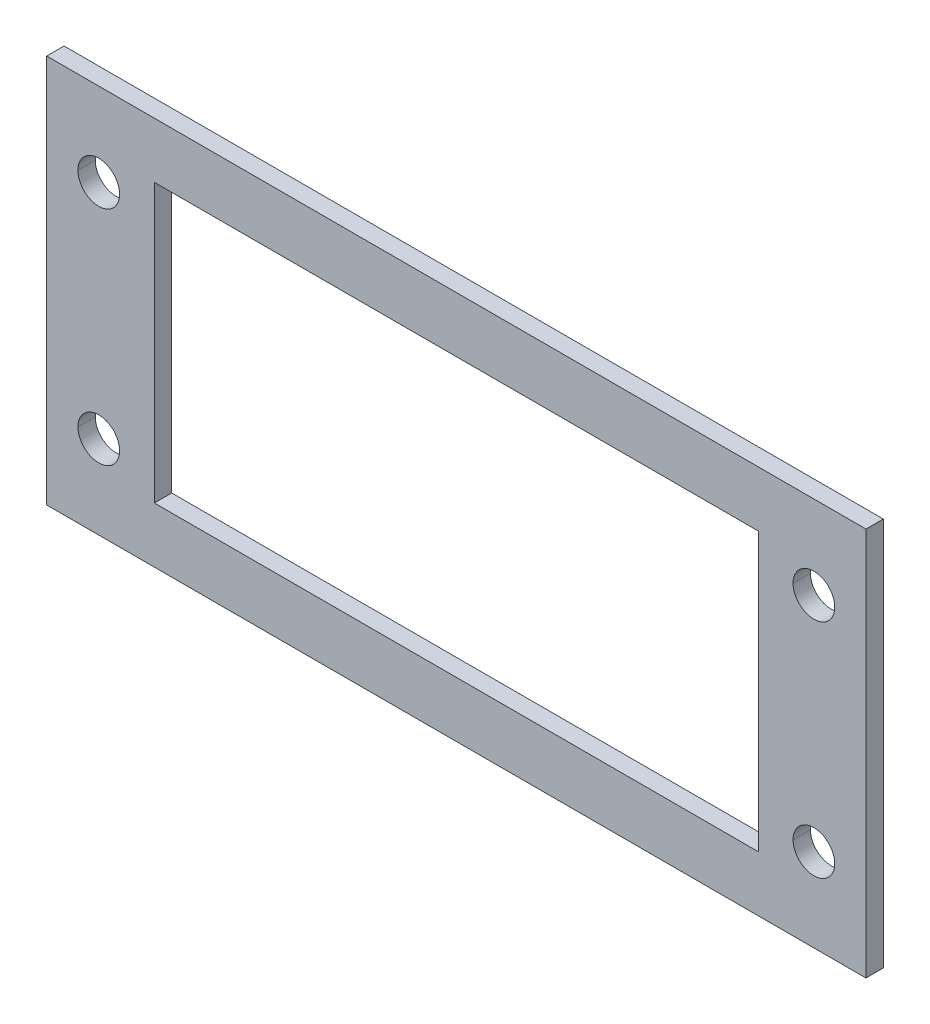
ISO-10303-21;
HEADER;
FILE_DESCRIPTION(('STEP AP214'),'2;1');
FILE_NAME('part.step','',(''),(''),'','','');
FILE_SCHEMA(('AUTOMOTIVE_DESIGN { 1 0 10303 214 1 1 1 1 }'));
ENDSEC;
DATA;
#1=APPLICATION_CONTEXT('core data for automotive mechanical design processes');
#2=APPLICATION_PROTOCOL_DEFINITION('international standard','automotive_design',2000,#1);
#3=PRODUCT_CONTEXT('',#1,'mechanical');
#4=PRODUCT('Part','Part','',(#3));
#5=PRODUCT_RELATED_PRODUCT_CATEGORY('part','',(#4));
#6=PRODUCT_DEFINITION_FORMATION('','',#4);
#7=PRODUCT_DEFINITION_CONTEXT('part definition',#1,'design');
#8=PRODUCT_DEFINITION('design','',#6,#7);
#9=PRODUCT_DEFINITION_SHAPE('','',#8);
#10=(LENGTH_UNIT() NAMED_UNIT(*) SI_UNIT(.MILLI.,.METRE.));
#11=(NAMED_UNIT(*) PLANE_ANGLE_UNIT() SI_UNIT($,.RADIAN.));
#12=(NAMED_UNIT(*) SI_UNIT($,.STERADIAN.) SOLID_ANGLE_UNIT());
#13=UNCERTAINTY_MEASURE_WITH_UNIT(LENGTH_MEASURE(1.E-05),#10,'distance_accuracy_value','');
#14=(GEOMETRIC_REPRESENTATION_CONTEXT(3) GLOBAL_UNCERTAINTY_ASSIGNED_CONTEXT((#13)) GLOBAL_UNIT_ASSIGNED_CONTEXT((#10,
#11,#12)) REPRESENTATION_CONTEXT('',''));
#15=CARTESIAN_POINT('',(0.,0.,0.));
#16=DIRECTION('',(0.,0.,1.));
#17=DIRECTION('',(1.,0.,0.));
#18=AXIS2_PLACEMENT_3D('',#15,#16,#17);
#19=CARTESIAN_POINT('',(51.5,16.,-0.0397186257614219));
#20=DIRECTION('',(0.,0.,-1.));
#21=DIRECTION('',(-1.,0.,0.));
#22=AXIS2_PLACEMENT_3D('',#19,#20,#21);
#23=CYLINDRICAL_SURFACE('',#22,3.);
#24=DIRECTION('',(0.,0.,-1.));
#25=VECTOR('',#24,1.);
#26=CARTESIAN_POINT('',(54.5,16.,-0.0397186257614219));
#27=LINE('',#26,#25);
#28=CARTESIAN_POINT('',(54.5,16.,-8.525));
#29=VERTEX_POINT('',#28);
#30=CARTESIAN_POINT('',(54.5,16.,-11.025));
#31=VERTEX_POINT('',#30);
#32=EDGE_CURVE('E201',#29,#31,#27,.T.);
#33=ORIENTED_EDGE('',*,*,#32,.F.);
#34=CARTESIAN_POINT('',(51.5,16.,-8.525));
#35=DIRECTION('',(0.,0.,-1.));
#36=DIRECTION('',(-1.,0.,0.));
#37=AXIS2_PLACEMENT_3D('',#34,#35,#36);
#38=CIRCLE('',#37,3.);
#39=CARTESIAN_POINT('',(48.5,16.,-8.525));
#40=VERTEX_POINT('',#39);
#41=EDGE_CURVE('E195',#40,#29,#38,.T.);
#42=ORIENTED_EDGE('',*,*,#41,.F.);
#43=DIRECTION('',(0.,0.,-1.));
#44=VECTOR('',#43,1.);
#45=CARTESIAN_POINT('',(48.5,16.,-0.0397186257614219));
#46=LINE('',#45,#44);
#47=CARTESIAN_POINT('',(48.5,16.,-11.025));
#48=VERTEX_POINT('',#47);
#49=EDGE_CURVE('E220',#40,#48,#46,.T.);
#50=ORIENTED_EDGE('',*,*,#49,.T.);
#51=CARTESIAN_POINT('',(51.5,16.,-11.025));
#52=DIRECTION('',(0.,0.,1.));
#53=DIRECTION('',(1.,0.,0.));
#54=AXIS2_PLACEMENT_3D('',#51,#52,#53);
#55=CIRCLE('',#54,3.);
#56=EDGE_CURVE('E206',#31,#48,#55,.T.);
#57=ORIENTED_EDGE('',*,*,#56,.F.);
#58=EDGE_LOOP('',(#33,#42,#50,#57));
#59=FACE_BOUND('',#58,.T.);
#60=ADVANCED_FACE('F15',(#59),#23,.F.);
#61=CARTESIAN_POINT('',(-51.5,16.,-0.0397186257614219));
#62=DIRECTION('',(0.,0.,-1.));
#63=DIRECTION('',(-1.,0.,0.));
#64=AXIS2_PLACEMENT_3D('',#61,#62,#63);
#65=CYLINDRICAL_SURFACE('',#64,3.);
#66=DIRECTION('',(0.,0.,-1.));
#67=VECTOR('',#66,1.);
#68=CARTESIAN_POINT('',(-48.5,16.,-0.0397186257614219));
#69=LINE('',#68,#67);
#70=CARTESIAN_POINT('',(-48.5,16.,-8.525));
#71=VERTEX_POINT('',#70);
#72=CARTESIAN_POINT('',(-48.5,16.,-11.025));
#73=VERTEX_POINT('',#72);
#74=EDGE_CURVE('E232',#71,#73,#69,.T.);
#75=ORIENTED_EDGE('',*,*,#74,.F.);
#76=CARTESIAN_POINT('',(-51.5,16.,-8.525));
#77=DIRECTION('',(0.,0.,-1.));
#78=DIRECTION('',(-1.,0.,0.));
#79=AXIS2_PLACEMENT_3D('',#76,#77,#78);
#80=CIRCLE('',#79,3.);
#81=CARTESIAN_POINT('',(-54.5,16.,-8.525));
#82=VERTEX_POINT('',#81);
#83=EDGE_CURVE('E306',#82,#71,#80,.T.);
#84=ORIENTED_EDGE('',*,*,#83,.F.);
#85=DIRECTION('',(0.,0.,-1.));
#86=VECTOR('',#85,1.);
#87=CARTESIAN_POINT('',(-54.5,16.,-0.0397186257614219));
#88=LINE('',#87,#86);
#89=CARTESIAN_POINT('',(-54.5,16.,-11.025));
#90=VERTEX_POINT('',#89);
#91=EDGE_CURVE('E246',#82,#90,#88,.T.);
#92=ORIENTED_EDGE('',*,*,#91,.T.);
#93=CARTESIAN_POINT('',(-51.5,16.,-11.025));
#94=DIRECTION('',(0.,0.,1.));
#95=DIRECTION('',(1.,0.,0.));
#96=AXIS2_PLACEMENT_3D('',#93,#94,#95);
#97=CIRCLE('',#96,3.);
#98=EDGE_CURVE('E313',#73,#90,#97,.T.);
#99=ORIENTED_EDGE('',*,*,#98,.F.);
#100=EDGE_LOOP('',(#75,#84,#92,#99));
#101=FACE_BOUND('',#100,.T.);
#102=ADVANCED_FACE('F367',(#101),#65,.F.);
#103=CARTESIAN_POINT('',(51.5,-16.,87.2298954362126));
#104=DIRECTION('',(0.,0.,-1.));
#105=DIRECTION('',(-1.,0.,0.));
#106=AXIS2_PLACEMENT_3D('',#103,#104,#105);
#107=CYLINDRICAL_SURFACE('',#106,3.);
#108=DIRECTION('',(0.,0.,-1.));
#109=VECTOR('',#108,1.);
#110=CARTESIAN_POINT('',(54.5,-16.,87.2298954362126));
#111=LINE('',#110,#109);
#112=CARTESIAN_POINT('',(54.5,-16.,-8.525));
#113=VERTEX_POINT('',#112);
#114=CARTESIAN_POINT('',(54.5,-16.,-11.025));
#115=VERTEX_POINT('',#114);
#116=EDGE_CURVE('E211',#113,#115,#111,.T.);
#117=ORIENTED_EDGE('',*,*,#116,.F.);
#118=CARTESIAN_POINT('',(51.5,-16.,-8.525));
#119=DIRECTION('',(0.,0.,-1.));
#120=DIRECTION('',(-1.,0.,0.));
#121=AXIS2_PLACEMENT_3D('',#118,#119,#120);
#122=CIRCLE('',#121,3.);
#123=CARTESIAN_POINT('',(48.5,-16.,-8.525));
#124=VERTEX_POINT('',#123);
#125=EDGE_CURVE('E303',#124,#113,#122,.T.);
#126=ORIENTED_EDGE('',*,*,#125,.F.);
#127=DIRECTION('',(0.,0.,-1.));
#128=VECTOR('',#127,1.);
#129=CARTESIAN_POINT('',(48.5,-16.,87.2298954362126));
#130=LINE('',#129,#128);
#131=CARTESIAN_POINT('',(48.5,-16.,-11.025));
#132=VERTEX_POINT('',#131);
#133=EDGE_CURVE('E224',#124,#132,#130,.T.);
#134=ORIENTED_EDGE('',*,*,#133,.T.);
#135=CARTESIAN_POINT('',(51.5,-16.,-11.025));
#136=DIRECTION('',(0.,0.,1.));
#137=DIRECTION('',(1.,0.,0.));
#138=AXIS2_PLACEMENT_3D('',#135,#136,#137);
#139=CIRCLE('',#138,3.);
#140=EDGE_CURVE('E210',#115,#132,#139,.T.);
#141=ORIENTED_EDGE('',*,*,#140,.F.);
#142=EDGE_LOOP('',(#117,#126,#134,#141));
#143=FACE_BOUND('',#142,.T.);
#144=ADVANCED_FACE('F372',(#143),#107,.F.);
#145=CARTESIAN_POINT('',(-51.5,-16.,87.2298954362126));
#146=DIRECTION('',(0.,0.,-1.));
#147=DIRECTION('',(-1.,0.,0.));
#148=AXIS2_PLACEMENT_3D('',#145,#146,#147);
#149=CYLINDRICAL_SURFACE('',#148,3.);
#150=DIRECTION('',(0.,0.,-1.));
#151=VECTOR('',#150,1.);
#152=CARTESIAN_POINT('',(-48.5,-16.,87.2298954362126));
#153=LINE('',#152,#151);
#154=CARTESIAN_POINT('',(-48.5,-16.,-8.525));
#155=VERTEX_POINT('',#154);
#156=CARTESIAN_POINT('',(-48.5,-16.,-11.025));
#157=VERTEX_POINT('',#156);
#158=EDGE_CURVE('E237',#155,#157,#153,.T.);
#159=ORIENTED_EDGE('',*,*,#158,.F.);
#160=CARTESIAN_POINT('',(-51.5,-16.,-8.525));
#161=DIRECTION('',(0.,0.,-1.));
#162=DIRECTION('',(-1.,0.,0.));
#163=AXIS2_PLACEMENT_3D('',#160,#161,#162);
#164=CIRCLE('',#163,3.);
#165=CARTESIAN_POINT('',(-54.5,-16.,-8.525));
#166=VERTEX_POINT('',#165);
#167=EDGE_CURVE('E300',#166,#155,#164,.T.);
#168=ORIENTED_EDGE('',*,*,#167,.F.);
#169=DIRECTION('',(0.,0.,-1.));
#170=VECTOR('',#169,1.);
#171=CARTESIAN_POINT('',(-54.5,-16.,87.2298954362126));
#172=LINE('',#171,#170);
#173=CARTESIAN_POINT('',(-54.5,-16.,-11.025));
#174=VERTEX_POINT('',#173);
#175=EDGE_CURVE('E250',#166,#174,#172,.T.);
#176=ORIENTED_EDGE('',*,*,#175,.T.);
#177=CARTESIAN_POINT('',(-51.5,-16.,-11.025));
#178=DIRECTION('',(0.,0.,1.));
#179=DIRECTION('',(1.,0.,0.));
#180=AXIS2_PLACEMENT_3D('',#177,#178,#179);
#181=CIRCLE('',#180,3.);
#182=EDGE_CURVE('E316',#157,#174,#181,.T.);
#183=ORIENTED_EDGE('',*,*,#182,.F.);
#184=EDGE_LOOP('',(#159,#168,#176,#183));
#185=FACE_BOUND('',#184,.T.);
#186=ADVANCED_FACE('F411',(#185),#149,.F.);
#187=CARTESIAN_POINT('',(-43.5,-20.,87.2298954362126));
#188=DIRECTION('',(1.,0.,0.));
#189=DIRECTION('',(0.,1.,0.));
#190=AXIS2_PLACEMENT_3D('',#187,#188,#189);
#191=PLANE('',#190);
#192=DIRECTION('',(0.,0.,-1.));
#193=VECTOR('',#192,1.);
#194=CARTESIAN_POINT('',(-43.5,-20.,87.2298954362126));
#195=LINE('',#194,#193);
#196=CARTESIAN_POINT('',(-43.5,-20.,-8.525));
#197=VERTEX_POINT('',#196);
#198=CARTESIAN_POINT('',(-43.5,-20.,-11.025));
#199=VERTEX_POINT('',#198);
#200=EDGE_CURVE('E10',#197,#199,#195,.T.);
#201=ORIENTED_EDGE('',*,*,#200,.T.);
#202=DIRECTION('',(0.,-1.,0.));
#203=VECTOR('',#202,1.);
#204=CARTESIAN_POINT('',(-43.5,-20.,-11.025));
#205=LINE('',#204,#203);
#206=CARTESIAN_POINT('',(-43.5,20.,-11.025));
#207=VERTEX_POINT('',#206);
#208=EDGE_CURVE('E327',#207,#199,#205,.T.);
#209=ORIENTED_EDGE('',*,*,#208,.F.);
#210=DIRECTION('',(0.,0.,-1.));
#211=VECTOR('',#210,1.);
#212=CARTESIAN_POINT('',(-43.5,20.,87.2298954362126));
#213=LINE('',#212,#211);
#214=CARTESIAN_POINT('',(-43.5,20.,-8.525));
#215=VERTEX_POINT('',#214);
#216=EDGE_CURVE('E42',#215,#207,#213,.T.);
#217=ORIENTED_EDGE('',*,*,#216,.F.);
#218=DIRECTION('',(0.,1.,0.));
#219=VECTOR('',#218,1.);
#220=CARTESIAN_POINT('',(-43.5,-20.,-8.525));
#221=LINE('',#220,#219);
#222=EDGE_CURVE('E296',#197,#215,#221,.T.);
#223=ORIENTED_EDGE('',*,*,#222,.F.);
#224=EDGE_LOOP('',(#201,#209,#217,#223));
#225=FACE_BOUND('',#224,.T.);
#226=ADVANCED_FACE('F418',(#225),#191,.T.);
#227=CARTESIAN_POINT('',(-43.5,-20.,87.2298954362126));
#228=DIRECTION('',(0.,1.,0.));
#229=DIRECTION('',(1.,0.,0.));
#230=AXIS2_PLACEMENT_3D('',#227,#228,#229);
#231=PLANE('',#230);
#232=DIRECTION('',(0.,0.,-1.));
#233=VECTOR('',#232,1.);
#234=CARTESIAN_POINT('',(43.5,-20.,87.2298954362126));
#235=LINE('',#234,#233);
#236=CARTESIAN_POINT('',(43.5,-20.,-8.525));
#237=VERTEX_POINT('',#236);
#238=CARTESIAN_POINT('',(43.5,-20.,-11.025));
#239=VERTEX_POINT('',#238);
#240=EDGE_CURVE('E23',#237,#239,#235,.T.);
#241=ORIENTED_EDGE('',*,*,#240,.T.);
#242=DIRECTION('',(1.,0.,0.));
#243=VECTOR('',#242,1.);
#244=CARTESIAN_POINT('',(-43.5,-20.,-11.025));
#245=LINE('',#244,#243);
#246=EDGE_CURVE('E331',#199,#239,#245,.T.);
#247=ORIENTED_EDGE('',*,*,#246,.F.);
#248=ORIENTED_EDGE('',*,*,#200,.F.);
#249=DIRECTION('',(-1.,0.,0.));
#250=VECTOR('',#249,1.);
#251=CARTESIAN_POINT('',(-43.5,-20.,-8.525));
#252=LINE('',#251,#250);
#253=EDGE_CURVE('E292',#237,#197,#252,.T.);
#254=ORIENTED_EDGE('',*,*,#253,.F.);
#255=EDGE_LOOP('',(#241,#247,#248,#254));
#256=FACE_BOUND('',#255,.T.);
#257=ADVANCED_FACE('F347',(#256),#231,.T.);
#258=CARTESIAN_POINT('',(43.5,-20.,87.2298954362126));
#259=DIRECTION('',(-1.,0.,0.));
#260=DIRECTION('',(0.,0.,1.));
#261=AXIS2_PLACEMENT_3D('',#258,#259,#260);
#262=PLANE('',#261);
#263=DIRECTION('',(0.,0.,-1.));
#264=VECTOR('',#263,1.);
#265=CARTESIAN_POINT('',(43.5,20.,87.2298954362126));
#266=LINE('',#265,#264);
#267=CARTESIAN_POINT('',(43.5,20.,-8.525));
#268=VERTEX_POINT('',#267);
#269=CARTESIAN_POINT('',(43.5,20.,-11.025));
#270=VERTEX_POINT('',#269);
#271=EDGE_CURVE('E341',#268,#270,#266,.T.);
#272=ORIENTED_EDGE('',*,*,#271,.T.);
#273=DIRECTION('',(0.,1.,0.));
#274=VECTOR('',#273,1.);
#275=CARTESIAN_POINT('',(43.5,-20.,-11.025));
#276=LINE('',#275,#274);
#277=EDGE_CURVE('E319',#239,#270,#276,.T.);
#278=ORIENTED_EDGE('',*,*,#277,.F.);
#279=ORIENTED_EDGE('',*,*,#240,.F.);
#280=DIRECTION('',(0.,-1.,0.));
#281=VECTOR('',#280,1.);
#282=CARTESIAN_POINT('',(43.5,-20.,-8.525));
#283=LINE('',#282,#281);
#284=EDGE_CURVE('E288',#268,#237,#283,.T.);
#285=ORIENTED_EDGE('',*,*,#284,.F.);
#286=EDGE_LOOP('',(#272,#278,#279,#285));
#287=FACE_BOUND('',#286,.T.);
#288=ADVANCED_FACE('F353',(#287),#262,.T.);
#289=CARTESIAN_POINT('',(-43.5,20.,87.2298954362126));
#290=DIRECTION('',(0.,-1.,0.));
#291=DIRECTION('',(0.,0.,-1.));
#292=AXIS2_PLACEMENT_3D('',#289,#290,#291);
#293=PLANE('',#292);
#294=ORIENTED_EDGE('',*,*,#216,.T.);
#295=DIRECTION('',(-1.,0.,0.));
#296=VECTOR('',#295,1.);
#297=CARTESIAN_POINT('',(-43.5,20.,-11.025));
#298=LINE('',#297,#296);
#299=EDGE_CURVE('E323',#270,#207,#298,.T.);
#300=ORIENTED_EDGE('',*,*,#299,.F.);
#301=ORIENTED_EDGE('',*,*,#271,.F.);
#302=DIRECTION('',(1.,0.,0.));
#303=VECTOR('',#302,1.);
#304=CARTESIAN_POINT('',(-43.5,20.,-8.525));
#305=LINE('',#304,#303);
#306=EDGE_CURVE('E284',#215,#268,#305,.T.);
#307=ORIENTED_EDGE('',*,*,#306,.F.);
#308=EDGE_LOOP('',(#294,#300,#301,#307));
#309=FACE_BOUND('',#308,.T.);
#310=ADVANCED_FACE('F354',(#309),#293,.T.);
#311=CARTESIAN_POINT('',(-59.,28.,-8.525));
#312=DIRECTION('',(0.,-1.,0.));
#313=DIRECTION('',(0.,0.,-1.));
#314=AXIS2_PLACEMENT_3D('',#311,#312,#313);
#315=PLANE('',#314);
#316=DIRECTION('',(-1.,0.,0.));
#317=VECTOR('',#316,1.);
#318=CARTESIAN_POINT('',(-59.,28.,-11.025));
#319=LINE('',#318,#317);
#320=CARTESIAN_POINT('',(59.,28.,-11.025));
#321=VERTEX_POINT('',#320);
#322=CARTESIAN_POINT('',(-59.,28.,-11.025));
#323=VERTEX_POINT('',#322);
#324=EDGE_CURVE('E168',#321,#323,#319,.T.);
#325=ORIENTED_EDGE('',*,*,#324,.T.);
#326=DIRECTION('',(0.,0.,-1.));
#327=VECTOR('',#326,1.);
#328=CARTESIAN_POINT('',(-59.,28.,-8.525));
#329=LINE('',#328,#327);
#330=CARTESIAN_POINT('',(-59.,28.,-8.525));
#331=VERTEX_POINT('',#330);
#332=EDGE_CURVE('E257',#331,#323,#329,.T.);
#333=ORIENTED_EDGE('',*,*,#332,.F.);
#334=DIRECTION('',(-1.,0.,0.));
#335=VECTOR('',#334,1.);
#336=CARTESIAN_POINT('',(-59.,28.,-8.525));
#337=LINE('',#336,#335);
#338=CARTESIAN_POINT('',(59.,28.,-8.525));
#339=VERTEX_POINT('',#338);
#340=EDGE_CURVE('E171',#339,#331,#337,.T.);
#341=ORIENTED_EDGE('',*,*,#340,.F.);
#342=DIRECTION('',(0.,0.,-1.));
#343=VECTOR('',#342,1.);
#344=CARTESIAN_POINT('',(59.,28.,-8.525));
#345=LINE('',#344,#343);
#346=EDGE_CURVE('E164',#339,#321,#345,.T.);
#347=ORIENTED_EDGE('',*,*,#346,.T.);
#348=EDGE_LOOP('',(#325,#333,#341,#347));
#349=FACE_BOUND('',#348,.T.);
#350=ADVANCED_FACE('F166',(#349),#315,.F.);
#351=CARTESIAN_POINT('',(59.,-28.,-8.525));
#352=DIRECTION('',(-1.,0.,0.));
#353=DIRECTION('',(0.,0.,1.));
#354=AXIS2_PLACEMENT_3D('',#351,#352,#353);
#355=PLANE('',#354);
#356=DIRECTION('',(0.,1.,0.));
#357=VECTOR('',#356,1.);
#358=CARTESIAN_POINT('',(59.,-28.,-11.025));
#359=LINE('',#358,#357);
#360=CARTESIAN_POINT('',(59.,-28.,-11.025));
#361=VERTEX_POINT('',#360);
#362=EDGE_CURVE('E179',#361,#321,#359,.T.);
#363=ORIENTED_EDGE('',*,*,#362,.T.);
#364=ORIENTED_EDGE('',*,*,#346,.F.);
#365=DIRECTION('',(0.,1.,0.));
#366=VECTOR('',#365,1.);
#367=CARTESIAN_POINT('',(59.,-28.,-8.525));
#368=LINE('',#367,#366);
#369=CARTESIAN_POINT('',(59.,-28.,-8.525));
#370=VERTEX_POINT('',#369);
#371=EDGE_CURVE('E279',#370,#339,#368,.T.);
#372=ORIENTED_EDGE('',*,*,#371,.F.);
#373=DIRECTION('',(0.,0.,-1.));
#374=VECTOR('',#373,1.);
#375=CARTESIAN_POINT('',(59.,-28.,-8.525));
#376=LINE('',#375,#374);
#377=EDGE_CURVE('E176',#370,#361,#376,.T.);
#378=ORIENTED_EDGE('',*,*,#377,.T.);
#379=EDGE_LOOP('',(#363,#364,#372,#378));
#380=FACE_BOUND('',#379,.T.);
#381=ADVANCED_FACE('F180',(#380),#355,.F.);
#382=CARTESIAN_POINT('',(-59.,-28.,-8.525));
#383=DIRECTION('',(0.,1.,0.));
#384=DIRECTION('',(1.,0.,0.));
#385=AXIS2_PLACEMENT_3D('',#382,#383,#384);
#386=PLANE('',#385);
#387=DIRECTION('',(1.,0.,0.));
#388=VECTOR('',#387,1.);
#389=CARTESIAN_POINT('',(-59.,-28.,-11.025));
#390=LINE('',#389,#388);
#391=CARTESIAN_POINT('',(-59.,-28.,-11.025));
#392=VERTEX_POINT('',#391);
#393=EDGE_CURVE('E185',#392,#361,#390,.T.);
#394=ORIENTED_EDGE('',*,*,#393,.T.);
#395=ORIENTED_EDGE('',*,*,#377,.F.);
#396=DIRECTION('',(1.,0.,0.));
#397=VECTOR('',#396,1.);
#398=CARTESIAN_POINT('',(-59.,-28.,-8.525));
#399=LINE('',#398,#397);
#400=CARTESIAN_POINT('',(-59.,-28.,-8.525));
#401=VERTEX_POINT('',#400);
#402=EDGE_CURVE('E275',#401,#370,#399,.T.);
#403=ORIENTED_EDGE('',*,*,#402,.F.);
#404=DIRECTION('',(0.,0.,-1.));
#405=VECTOR('',#404,1.);
#406=CARTESIAN_POINT('',(-59.,-28.,-8.525));
#407=LINE('',#406,#405);
#408=EDGE_CURVE('E209',#401,#392,#407,.T.);
#409=ORIENTED_EDGE('',*,*,#408,.T.);
#410=EDGE_LOOP('',(#394,#395,#403,#409));
#411=FACE_BOUND('',#410,.T.);
#412=ADVANCED_FACE('F398',(#411),#386,.F.);
#413=CARTESIAN_POINT('',(-59.,-28.,-8.525));
#414=DIRECTION('',(1.,0.,0.));
#415=DIRECTION('',(0.,1.,0.));
#416=AXIS2_PLACEMENT_3D('',#413,#414,#415);
#417=PLANE('',#416);
#418=DIRECTION('',(0.,-1.,0.));
#419=VECTOR('',#418,1.);
#420=CARTESIAN_POINT('',(-59.,-28.,-11.025));
#421=LINE('',#420,#419);
#422=EDGE_CURVE('E189',#323,#392,#421,.T.);
#423=ORIENTED_EDGE('',*,*,#422,.T.);
#424=ORIENTED_EDGE('',*,*,#408,.F.);
#425=DIRECTION('',(0.,-1.,0.));
#426=VECTOR('',#425,1.);
#427=CARTESIAN_POINT('',(-59.,-28.,-8.525));
#428=LINE('',#427,#426);
#429=EDGE_CURVE('E271',#331,#401,#428,.T.);
#430=ORIENTED_EDGE('',*,*,#429,.F.);
#431=ORIENTED_EDGE('',*,*,#332,.T.);
#432=EDGE_LOOP('',(#423,#424,#430,#431));
#433=FACE_BOUND('',#432,.T.);
#434=ADVANCED_FACE('F396',(#433),#417,.F.);
#435=CARTESIAN_POINT('',(-59.,28.,-11.025));
#436=DIRECTION('',(0.,0.,-1.));
#437=DIRECTION('',(0.,-1.,0.));
#438=AXIS2_PLACEMENT_3D('',#435,#436,#437);
#439=PLANE('',#438);
#440=CARTESIAN_POINT('',(51.5,16.,-11.025));
#441=DIRECTION('',(0.,0.,1.));
#442=DIRECTION('',(1.,0.,0.));
#443=AXIS2_PLACEMENT_3D('',#440,#441,#442);
#444=CIRCLE('',#443,3.);
#445=EDGE_CURVE('E205',#48,#31,#444,.T.);
#446=ORIENTED_EDGE('',*,*,#445,.T.);
#447=ORIENTED_EDGE('',*,*,#56,.T.);
#448=EDGE_LOOP('',(#446,#447));
#449=FACE_BOUND('',#448,.T.);
#450=CARTESIAN_POINT('',(51.5,-16.,-11.025));
#451=DIRECTION('',(0.,0.,1.));
#452=DIRECTION('',(1.,0.,0.));
#453=AXIS2_PLACEMENT_3D('',#450,#451,#452);
#454=CIRCLE('',#453,3.);
#455=EDGE_CURVE('E215',#132,#115,#454,.T.);
#456=ORIENTED_EDGE('',*,*,#455,.T.);
#457=ORIENTED_EDGE('',*,*,#140,.T.);
#458=EDGE_LOOP('',(#456,#457));
#459=FACE_BOUND('',#458,.T.);
#460=ORIENTED_EDGE('',*,*,#277,.T.);
#461=ORIENTED_EDGE('',*,*,#299,.T.);
#462=ORIENTED_EDGE('',*,*,#208,.T.);
#463=ORIENTED_EDGE('',*,*,#246,.T.);
#464=EDGE_LOOP('',(#460,#461,#462,#463));
#465=FACE_BOUND('',#464,.T.);
#466=CARTESIAN_POINT('',(-51.5,-16.,-11.025));
#467=DIRECTION('',(0.,0.,1.));
#468=DIRECTION('',(1.,0.,0.));
#469=AXIS2_PLACEMENT_3D('',#466,#467,#468);
#470=CIRCLE('',#469,3.);
#471=EDGE_CURVE('E241',#174,#157,#470,.T.);
#472=ORIENTED_EDGE('',*,*,#471,.T.);
#473=ORIENTED_EDGE('',*,*,#182,.T.);
#474=EDGE_LOOP('',(#472,#473));
#475=FACE_BOUND('',#474,.T.);
#476=CARTESIAN_POINT('',(-51.5,16.,-11.025));
#477=DIRECTION('',(0.,0.,1.));
#478=DIRECTION('',(1.,0.,0.));
#479=AXIS2_PLACEMENT_3D('',#476,#477,#478);
#480=CIRCLE('',#479,3.);
#481=EDGE_CURVE('E235',#90,#73,#480,.T.);
#482=ORIENTED_EDGE('',*,*,#481,.T.);
#483=ORIENTED_EDGE('',*,*,#98,.T.);
#484=EDGE_LOOP('',(#482,#483));
#485=FACE_BOUND('',#484,.T.);
#486=ORIENTED_EDGE('',*,*,#422,.F.);
#487=ORIENTED_EDGE('',*,*,#324,.F.);
#488=ORIENTED_EDGE('',*,*,#362,.F.);
#489=ORIENTED_EDGE('',*,*,#393,.F.);
#490=EDGE_LOOP('',(#486,#487,#488,#489));
#491=FACE_BOUND('',#490,.T.);
#492=ADVANCED_FACE('F187',(#449,#459,#465,#475,#485,#491),#439,.T.);
#493=CARTESIAN_POINT('',(-59.,28.,-8.525));
#494=DIRECTION('',(0.,0.,-1.));
#495=DIRECTION('',(0.,-1.,0.));
#496=AXIS2_PLACEMENT_3D('',#493,#494,#495);
#497=PLANE('',#496);
#498=ORIENTED_EDGE('',*,*,#41,.T.);
#499=CARTESIAN_POINT('',(51.5,16.,-8.525));
#500=DIRECTION('',(0.,0.,-1.));
#501=DIRECTION('',(-1.,0.,0.));
#502=AXIS2_PLACEMENT_3D('',#499,#500,#501);
#503=CIRCLE('',#502,3.);
#504=EDGE_CURVE('E198',#29,#40,#503,.T.);
#505=ORIENTED_EDGE('',*,*,#504,.T.);
#506=EDGE_LOOP('',(#498,#505));
#507=FACE_BOUND('',#506,.T.);
#508=ORIENTED_EDGE('',*,*,#83,.T.);
#509=CARTESIAN_POINT('',(-51.5,16.,-8.525));
#510=DIRECTION('',(0.,0.,-1.));
#511=DIRECTION('',(-1.,0.,0.));
#512=AXIS2_PLACEMENT_3D('',#509,#510,#511);
#513=CIRCLE('',#512,3.);
#514=EDGE_CURVE('E228',#71,#82,#513,.T.);
#515=ORIENTED_EDGE('',*,*,#514,.T.);
#516=EDGE_LOOP('',(#508,#515));
#517=FACE_BOUND('',#516,.T.);
#518=ORIENTED_EDGE('',*,*,#125,.T.);
#519=CARTESIAN_POINT('',(51.5,-16.,-8.525));
#520=DIRECTION('',(0.,0.,-1.));
#521=DIRECTION('',(-1.,0.,0.));
#522=AXIS2_PLACEMENT_3D('',#519,#520,#521);
#523=CIRCLE('',#522,3.);
#524=EDGE_CURVE('E216',#113,#124,#523,.T.);
#525=ORIENTED_EDGE('',*,*,#524,.T.);
#526=EDGE_LOOP('',(#518,#525));
#527=FACE_BOUND('',#526,.T.);
#528=ORIENTED_EDGE('',*,*,#167,.T.);
#529=CARTESIAN_POINT('',(-51.5,-16.,-8.525));
#530=DIRECTION('',(0.,0.,-1.));
#531=DIRECTION('',(-1.,0.,0.));
#532=AXIS2_PLACEMENT_3D('',#529,#530,#531);
#533=CIRCLE('',#532,3.);
#534=EDGE_CURVE('E242',#155,#166,#533,.T.);
#535=ORIENTED_EDGE('',*,*,#534,.T.);
#536=EDGE_LOOP('',(#528,#535));
#537=FACE_BOUND('',#536,.T.);
#538=ORIENTED_EDGE('',*,*,#306,.T.);
#539=ORIENTED_EDGE('',*,*,#284,.T.);
#540=ORIENTED_EDGE('',*,*,#253,.T.);
#541=ORIENTED_EDGE('',*,*,#222,.T.);
#542=EDGE_LOOP('',(#538,#539,#540,#541));
#543=FACE_BOUND('',#542,.T.);
#544=ORIENTED_EDGE('',*,*,#429,.T.);
#545=ORIENTED_EDGE('',*,*,#402,.T.);
#546=ORIENTED_EDGE('',*,*,#371,.T.);
#547=ORIENTED_EDGE('',*,*,#340,.T.);
#548=EDGE_LOOP('',(#544,#545,#546,#547));
#549=FACE_BOUND('',#548,.T.);
#550=ADVANCED_FACE('F381',(#507,#517,#527,#537,#543,#549),#497,.F.);
#551=CARTESIAN_POINT('',(-51.5,-16.,87.2298954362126));
#552=DIRECTION('',(0.,0.,-1.));
#553=DIRECTION('',(-1.,0.,0.));
#554=AXIS2_PLACEMENT_3D('',#551,#552,#553);
#555=CYLINDRICAL_SURFACE('',#554,3.);
#556=ORIENTED_EDGE('',*,*,#534,.F.);
#557=ORIENTED_EDGE('',*,*,#158,.T.);
#558=ORIENTED_EDGE('',*,*,#471,.F.);
#559=ORIENTED_EDGE('',*,*,#175,.F.);
#560=EDGE_LOOP('',(#556,#557,#558,#559));
#561=FACE_BOUND('',#560,.T.);
#562=ADVANCED_FACE('F384',(#561),#555,.F.);
#563=CARTESIAN_POINT('',(51.5,-16.,87.2298954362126));
#564=DIRECTION('',(0.,0.,-1.));
#565=DIRECTION('',(-1.,0.,0.));
#566=AXIS2_PLACEMENT_3D('',#563,#564,#565);
#567=CYLINDRICAL_SURFACE('',#566,3.);
#568=ORIENTED_EDGE('',*,*,#524,.F.);
#569=ORIENTED_EDGE('',*,*,#116,.T.);
#570=ORIENTED_EDGE('',*,*,#455,.F.);
#571=ORIENTED_EDGE('',*,*,#133,.F.);
#572=EDGE_LOOP('',(#568,#569,#570,#571));
#573=FACE_BOUND('',#572,.T.);
#574=ADVANCED_FACE('F429',(#573),#567,.F.);
#575=CARTESIAN_POINT('',(-51.5,16.,-0.0397186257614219));
#576=DIRECTION('',(0.,0.,-1.));
#577=DIRECTION('',(-1.,0.,0.));
#578=AXIS2_PLACEMENT_3D('',#575,#576,#577);
#579=CYLINDRICAL_SURFACE('',#578,3.);
#580=ORIENTED_EDGE('',*,*,#514,.F.);
#581=ORIENTED_EDGE('',*,*,#74,.T.);
#582=ORIENTED_EDGE('',*,*,#481,.F.);
#583=ORIENTED_EDGE('',*,*,#91,.F.);
#584=EDGE_LOOP('',(#580,#581,#582,#583));
#585=FACE_BOUND('',#584,.T.);
#586=ADVANCED_FACE('F428',(#585),#579,.F.);
#587=CARTESIAN_POINT('',(51.5,16.,-0.0397186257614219));
#588=DIRECTION('',(0.,0.,-1.));
#589=DIRECTION('',(-1.,0.,0.));
#590=AXIS2_PLACEMENT_3D('',#587,#588,#589);
#591=CYLINDRICAL_SURFACE('',#590,3.);
#592=ORIENTED_EDGE('',*,*,#504,.F.);
#593=ORIENTED_EDGE('',*,*,#32,.T.);
#594=ORIENTED_EDGE('',*,*,#445,.F.);
#595=ORIENTED_EDGE('',*,*,#49,.F.);
#596=EDGE_LOOP('',(#592,#593,#594,#595));
#597=FACE_BOUND('',#596,.T.);
#598=ADVANCED_FACE('F379',(#597),#591,.F.);
#599=CLOSED_SHELL('',(#60,#102,#144,#186,#226,#257,#288,#310,#350,#381,#412,#434,#492,#550,#562,
#574,#586,#598));
#600=MANIFOLD_SOLID_BREP('B1',#599);
#601=ADVANCED_BREP_SHAPE_REPRESENTATION('',(#18,#600),#14);
#602=SHAPE_DEFINITION_REPRESENTATION(#9,#601);
ENDSEC;
END-ISO-10303-21;
